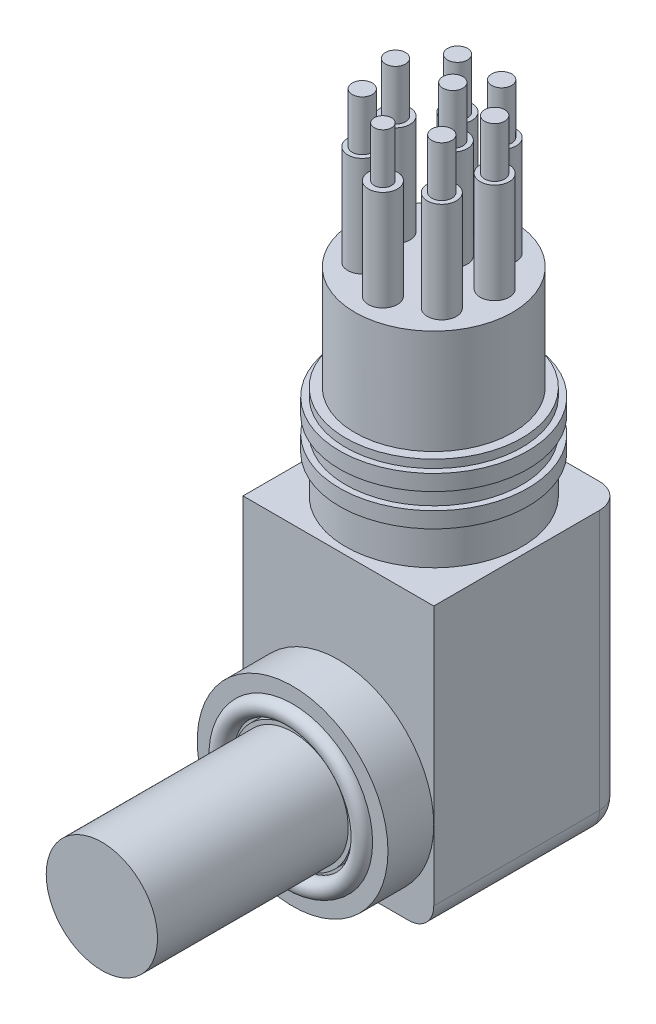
from build123d import *

# Parameters (mm, degrees)
SKETCH1_W          = 19.05
SKETCH1_H          = 19.05
EXTRUDE1_DEPTH     = 28.448
SKETCH3_R          = 7.874
EXTRUDE2_DEPTH     = 10.414
SKETCH10_R         = 9.525
EXTRUDE8_DEPTH     = 4.572
SKETCH11_R         = 7.9885
SKETCH11_R_2       = 5.9565
CUT_EXTRUDE1_DEPTH = 1.27
SKETCH8_R          = 5.55625
EXTRUDE7_DEPTH     = 19.05
SKETCH9_R          = 0.89
FILLET1_R          = 2.5
SKETCH4_R          = 1.45
EXTRUDE9_DEPTH     = 10
SKETCH_1_R         = 1.45
EXTRUDE10_DEPTH    = 10
SKETCH12_R         = 0.864827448
EXTRUDE11_DEPTH    = 5
SKETCH13_R         = 1
EXTRUDE12_DEPTH    = 5
CIRPATTERN3_COUNT  = 7
SKETCH14_R         = 1
EXTRUDE13_DEPTH    = 5
EXTRUDE13_2_DEPTH  = 5
EXTRUDE13_3_DEPTH  = 5
EXTRUDE13_4_DEPTH  = 5
EXTRUDE13_5_DEPTH  = 5
EXTRUDE13_6_DEPTH  = 5


with BuildPart() as part:
    # Sketch1 → Extrude1 (new body)
    with BuildSketch(Plane(origin=(0, 0, 0), x_dir=(1, 0, 0), z_dir=(0, 1, 0))):
        Rectangle(SKETCH1_W, SKETCH1_H)
    extrude(amount=EXTRUDE1_DEPTH)

    # Sketch2 → Revolve1 (revolve)
    with BuildSketch(Plane.XY, mode=Mode.PRIVATE) as revolve1_sk:
        Polygon((8.8011, 28.448), (8.8011, 32.2326), (9.398, 32.2326), (9.398, 33.8074), (8.8011, 33.8074), (8.8011, 35.4584), (9.398, 35.4584), (9.398, 37.0332), (8.8011, 37.0332), (8.8011, 37.846), (0, 37.846), (0, 28.448), align=None)
    revolve(revolve1_sk.sketch.rotate(Axis((0, 0, 0), (0, -1, 0)), 180), axis=Axis((0, 0, 0), (0, -1, 0)))

    # Sketch3 → Extrude2 (add)
    with BuildSketch(Plane(origin=(0, 37.846, 0), x_dir=(-1, 0, 0), z_dir=(0, 1, 0))):
        with Locations(Location((0, 0, 0), (0, 0, 180))):
            Circle(SKETCH3_R)
    extrude(amount=EXTRUDE2_DEPTH)

    # Sketch10 → Extrude8 (add)
    with BuildSketch(Plane.XY.offset(9.525)):
        with Locations((0, 9.525)):
            Circle(SKETCH10_R)
    extrude(amount=EXTRUDE8_DEPTH)

    # Sketch11 → Cut-Extrude1 (cut)
    with BuildSketch(Plane.XY.offset(14.097)):
        with Locations((0, 9.525)):
            Circle(SKETCH11_R)
        with Locations((0, 9.525)):
            Circle(SKETCH11_R_2, mode=Mode.SUBTRACT)
    extrude(amount=-CUT_EXTRUDE1_DEPTH, mode=Mode.SUBTRACT)

    # Sketch8 → Extrude7 (add)
    with BuildSketch(Plane(origin=(0, 12.8, 14.097), x_dir=(1, 0, 0), z_dir=(0, 0, -1))):
        with Locations(Location((0, 3.275, 0), (0, 0, 180))):
            Circle(SKETCH8_R)
    extrude(amount=-EXTRUDE7_DEPTH)

    # Sketch9 → o-ring 12.42x1.78 (revolve)
    with BuildSketch(Plane(origin=(0, -0.125998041, 0.125998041), x_dir=(0, 1, 0), z_dir=(1, 0, 0)), mode=Mode.PRIVATE) as o_ring_12_42x1_78_sk:
        with Locations((16.750998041, 13.971001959)):
            Circle(SKETCH9_R)
    revolve(o_ring_12_42x1_78_sk.sketch.rotate(Axis((0, 9.525, 13.263482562), (0, 0, -1)), 90), axis=Axis((0, 9.525, 13.263482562), (0, 0, -1)))

    # Fillet1
    fillet1_edges = [part.edges().sort_by_distance(p)[0] for p in [
        (0, 0, -9.525),
        (9.525, 0, 0),
        (-9.525, 0, 0),
        (-9.525, 14.224, -9.525),
        (9.525, 14.224, -9.525),
    ]]
    fillet(fillet1_edges, radius=FILLET1_R)

    # Sketch4 → Extrude9 (add)
    with BuildSketch(Plane(origin=(0, 48.26, 0), x_dir=(-1, 0, 0), z_dir=(0, 1, 0))):
        with Locations((0, 5.08)):
            Circle(SKETCH4_R)
    extrude9 = extrude(amount=EXTRUDE9_DEPTH)

    # Sketch 1 → Extrude10 (add)
    with BuildSketch(Plane(origin=(0.09953018, 48.26, 4.480198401), x_dir=(-1, 0, 0), z_dir=(0, 1, 0))):
        with Locations((0.09953018, -6.385198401)):
            Circle(SKETCH_1_R)
    extrude(amount=EXTRUDE10_DEPTH)

    # CirPattern3: Extrude9 ×7 about axis
    cirpattern3_axis = Axis((0, 0, 0), (0, 1, 0))
    for i in range(1, CIRPATTERN3_COUNT):
        add(extrude9.rotate(cirpattern3_axis, i * 360 / CIRPATTERN3_COUNT))


with BuildPart() as body_2:
    # Sketch12 → Extrude11 (new body)
    with BuildSketch(Plane(origin=(0, 58.26, 0), x_dir=(-1, 0, 0), z_dir=(0, 1, 0))):
        with Locations((0, 5.08)):
            Circle(SKETCH12_R)
    extrude(amount=EXTRUDE11_DEPTH)


with BuildPart() as body_3:
    # Sketch13 → Extrude12 (new body)
    with BuildSketch(Plane(origin=(0, 58.26, 0), x_dir=(-1, 0, 0), z_dir=(0, 1, 0))):
        with Locations((0, -1.905)):
            Circle(SKETCH13_R)
    extrude(amount=EXTRUDE12_DEPTH)


with BuildPart() as body_4:
    # Sketch14 → Extrude13 (new body)
    with BuildSketch(Plane(origin=(0, 58.26, 0), x_dir=(-1, 0, 0), z_dir=(0, 1, 0))):
        with Locations((3.971703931, 3.167328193)):
            Circle(SKETCH14_R)
    extrude(amount=EXTRUDE13_DEPTH)


with BuildPart() as body_5:
    # Sketch14 → Extrude13 2 (new body)
    with BuildSketch(Plane(origin=(0, 58.26, 0), x_dir=(-1, 0, 0), z_dir=(0, 1, 0))):
        with Locations((4.952633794, -1.130406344)):
            Circle(SKETCH14_R)
    extrude(amount=EXTRUDE13_2_DEPTH)


with BuildPart() as body_6:
    # Sketch14 → Extrude13 3 (new body)
    with BuildSketch(Plane(origin=(0, 58.26, 0), x_dir=(-1, 0, 0), z_dir=(0, 1, 0))):
        with Locations((2.204129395, -4.576921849)):
            Circle(SKETCH14_R)
    extrude(amount=EXTRUDE13_3_DEPTH)


with BuildPart() as body_7:
    # Sketch14 → Extrude13 4 (new body)
    with BuildSketch(Plane(origin=(0, 58.26, 0), x_dir=(-1, 0, 0), z_dir=(0, 1, 0))):
        with Locations((-2.204129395, -4.576921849)):
            Circle(SKETCH14_R)
    extrude(amount=EXTRUDE13_4_DEPTH)


with BuildPart() as body_8:
    # Sketch14 → Extrude13 5 (new body)
    with BuildSketch(Plane(origin=(0, 58.26, 0), x_dir=(-1, 0, 0), z_dir=(0, 1, 0))):
        with Locations((-4.952633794, -1.130406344)):
            Circle(SKETCH14_R)
    extrude(amount=EXTRUDE13_5_DEPTH)


with BuildPart() as body_9:
    # Sketch14 → Extrude13 6 (new body)
    with BuildSketch(Plane(origin=(0, 58.26, 0), x_dir=(-1, 0, 0), z_dir=(0, 1, 0))):
        with Locations((-3.971703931, 3.167328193)):
            Circle(SKETCH14_R)
    extrude(amount=EXTRUDE13_6_DEPTH)


solid = Compound([part.part, body_2.part, body_3.part, body_4.part, body_5.part, body_6.part, body_7.part, body_8.part, body_9.part])
